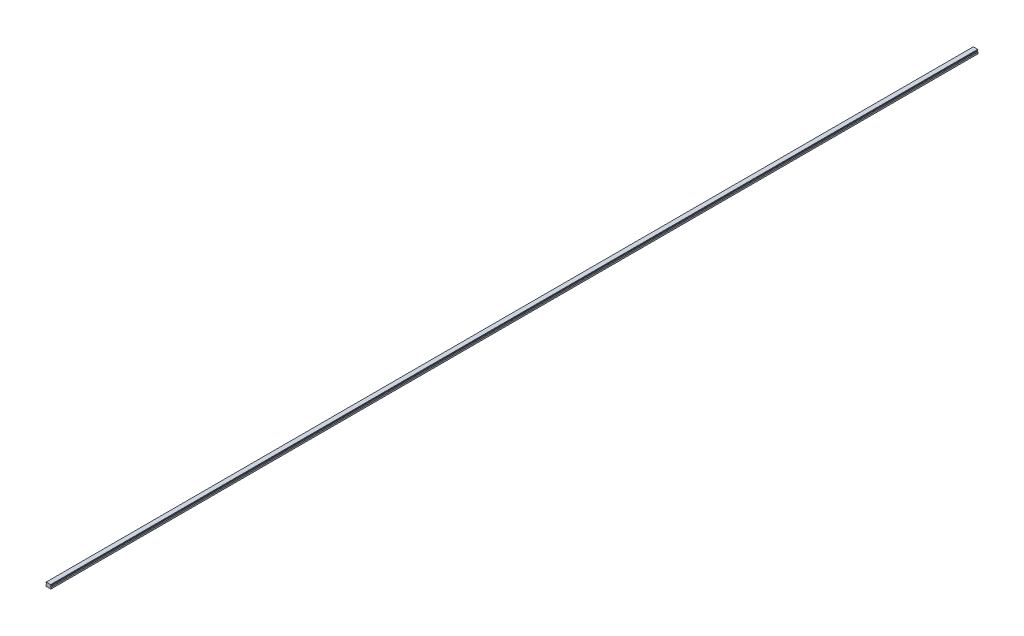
from build123d import *

# Parameters (mm, degrees)
SKETCH1_W           = 20
SKETCH1_H           = 16.3
BOSS_EXTRUDE1_DEPTH = 1880
CUT_EXTRUDE1_DEPTH  = 3761.048628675
CHAMFER1_SIZE       = 1
FILLET1_R           = 1
CUT_EXTRUDE2_DEPTH  = 3761.048628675
SKETCH5_R           = 3
SKETCH5_R_2         = 2.5
CUT_EXTRUDE5_DEPTH  = 10
SKETCH5_2_R         = 2.5
CUT_EXTRUDE6_DEPTH  = 13
LPATTERN2_COUNT     = 63
LPATTERN2_PITCH     = 60


with BuildPart() as part:
    # Sketch1 → Boss-Extrude1 (new, symmetric)
    with BuildSketch(Plane.XY):
        with Locations((0, 8.15)):
            Rectangle(SKETCH1_W, SKETCH1_H)
    extrude(amount=BOSS_EXTRUDE1_DEPTH, both=True)

    # Sketch2 → Cut-Extrude1 (cut, through all)
    with BuildSketch(Plane.XY.offset(1880)):
        Polygon((-10, 14.3), (-10, 7.3), (-7.666666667, 9.633333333), (-7.666666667, 11.966666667), align=None)
        Polygon((7.666666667, 11.966666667), (10, 14.3), (10, 7.3), (7.666666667, 9.633333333), align=None)
    extrude(amount=-CUT_EXTRUDE1_DEPTH, mode=Mode.SUBTRACT)

    # Chamfer1
    chamfer1_edges = [part.edges().sort_by_distance(p)[0] for p in [
        (-10, 16.3, 0),
        (10, 16.3, 0),
        (10, 0, 0),
        (-10, 0, 0),
    ]]
    chamfer(chamfer1_edges, length=CHAMFER1_SIZE)

    # Fillet1
    fillet1_edges = [part.edges().sort_by_distance(p)[0] for p in [
        (-7.666666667, 11.966666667, 0),
        (-7.666666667, 9.633333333, 0),
        (7.666666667, 9.633333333, 0),
        (7.666666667, 11.966666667, 0),
    ]]
    fillet(fillet1_edges, radius=FILLET1_R)

    # Sketch3 → Cut-Extrude2 (cut, through all)
    with BuildSketch(Plane.XY.offset(1880)):
        Polygon((-6, 0), (-5, 1), (5, 1), (6, 0), align=None)
    extrude(amount=-CUT_EXTRUDE2_DEPTH, mode=Mode.SUBTRACT)

    # Sketch5 → Cut-Extrude5 (cut)
    with BuildSketch(Plane.XZ.offset(-1)):
        with Locations(Location((0, 1860, 0), (0, 0, 270))):
            Circle(SKETCH5_R)
        with Locations(Location((0, 1860, 0), (0, 0, 270))):
            Circle(SKETCH5_R_2, mode=Mode.SUBTRACT)
    cut_extrude5 = extrude(amount=-CUT_EXTRUDE5_DEPTH, mode=Mode.SUBTRACT)

    # Sketch5_2 → Cut-Extrude6 (cut)
    with BuildSketch(Plane.XZ.offset(-1)):
        with Locations(Location((0, 1860, 0), (0, 0, 270))):
            Circle(SKETCH5_2_R)
    cut_extrude6 = extrude(amount=-CUT_EXTRUDE6_DEPTH, mode=Mode.SUBTRACT)

    # Cut-Extrude7 cone 1 section (on through the dimple's axis) → Cut-Extrude7 (revolve, cut)
    with BuildSketch(Plane(origin=(0, 14, 1860), x_dir=(0, 0, -1), z_dir=(1, 0, 0))):
        Polygon((0, 0), (2.5, 0), (0, 1.443375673), align=None)
    cut_extrude7 = revolve(axis=Axis((0, 14, 1860), (0, 1, 0)), mode=Mode.SUBTRACT)

    # LPattern2: Cut-Extrude5, Cut-Extrude6, Cut-Extrude7 ×63
    with Locations(*[(0, 0, -i * LPATTERN2_PITCH) for i in range(1, LPATTERN2_COUNT)]):
        add(cut_extrude5, mode=Mode.SUBTRACT)
        add(cut_extrude6, mode=Mode.SUBTRACT)
        add(cut_extrude7, mode=Mode.SUBTRACT)


solid = part.part
